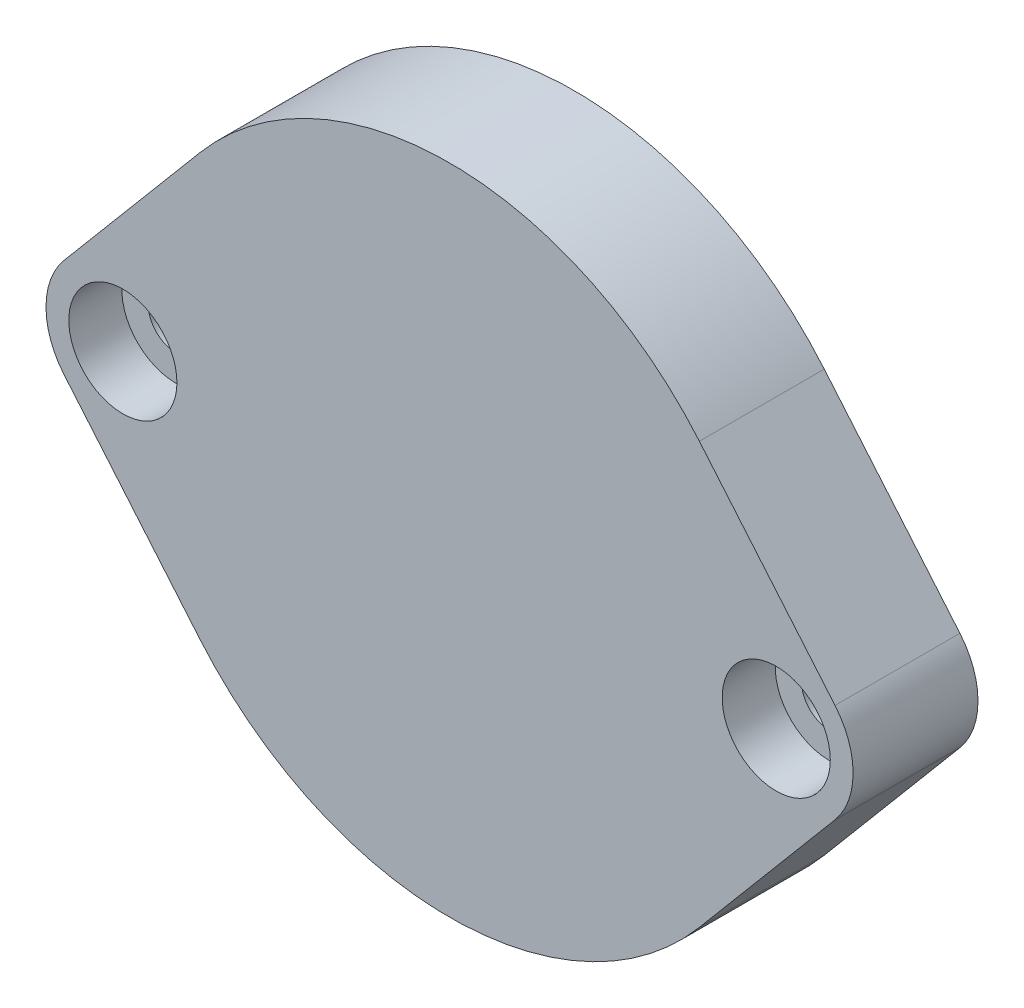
from build123d import *

# Parameters (mm, degrees)
SKETCH1_R                                      = 5.08
SKETCH1_R_2                                    = 21.59
BOSS_EXTRUDE1_DEPTH                            = 8.255
CBORE_FOR_6_SOCKET_HEAD_CAP_SCREW1_D           = 3.6576
CBORE_FOR_6_SOCKET_HEAD_CAP_SCREW1_CBORE_D     = 7.14502
CBORE_FOR_6_SOCKET_HEAD_CAP_SCREW1_CBORE_DEPTH = 3.5052


with BuildPart() as part:
    # Sketch1 → Boss-Extrude1 (new body)
    with BuildSketch(Plane.XY):
        with Locations((21.59, 0)):
            Circle(SKETCH1_R)
        Circle(SKETCH1_R_2)
        with Locations((-21.59, 0)):
            Circle(SKETCH1_R)
        Circle(SKETCH1_R_2)
        with Locations((-21.59, 0)):
            Circle(SKETCH1_R)
        Circle(SKETCH1_R_2)
        with Locations((21.59, 0)):
            Circle(SKETCH1_R)
        with Locations((21.59, 0)):
            Circle(SKETCH1_R)
        Circle(SKETCH1_R_2)
        with BuildLine():
            Line((25.474705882, 3.273447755), (16.51, 13.912152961))
            ThreePointArc((16.51, 13.912152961), (19.268223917, 9.739797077), (20.992352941, 5.044721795))
            ThreePointArc((20.992352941, 5.044721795), (23.456960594, 4.724495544), (25.474705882, 3.273447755))
        make_face()
        Circle(SKETCH1_R_2)
        with Locations((-21.59, 0)):
            Circle(SKETCH1_R)
        with BuildLine():
            ThreePointArc((-20.992352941, 5.044721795), (-19.268223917, 9.739797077), (-16.51, 13.912152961))
            Line((-16.51, 13.912152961), (-25.474705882, 3.273447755))
            ThreePointArc((-25.474705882, 3.273447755), (-23.456960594, 4.724495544), (-20.992352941, 5.044721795))
        make_face()
        with BuildLine():
            ThreePointArc((-20.992352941, -5.044721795), (-23.456960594, -4.724495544), (-25.474705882, -3.273447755))
            Line((-25.474705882, -3.273447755), (-16.51, -13.912152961))
            ThreePointArc((-16.51, -13.912152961), (-19.268223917, -9.739797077), (-20.992352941, -5.044721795))
        make_face()
        with BuildLine():
            ThreePointArc((25.474705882, -3.273447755), (23.456960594, -4.724495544), (20.992352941, -5.044721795))
            ThreePointArc((20.992352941, -5.044721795), (19.268223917, -9.739797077), (16.51, -13.912152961))
            Line((16.51, -13.912152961), (25.474705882, -3.273447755))
        make_face()
    extrude(amount=BOSS_EXTRUDE1_DEPTH)

    # CBORE for _6 Socket Head Cap Screw1 (through all)
    with Locations(Plane.XY.offset(8.255)):
        with Locations((-21.59, 0), (21.59, 0)):
            CounterBoreHole(CBORE_FOR_6_SOCKET_HEAD_CAP_SCREW1_D / 2, CBORE_FOR_6_SOCKET_HEAD_CAP_SCREW1_CBORE_D / 2, CBORE_FOR_6_SOCKET_HEAD_CAP_SCREW1_CBORE_DEPTH)


solid = part.part
